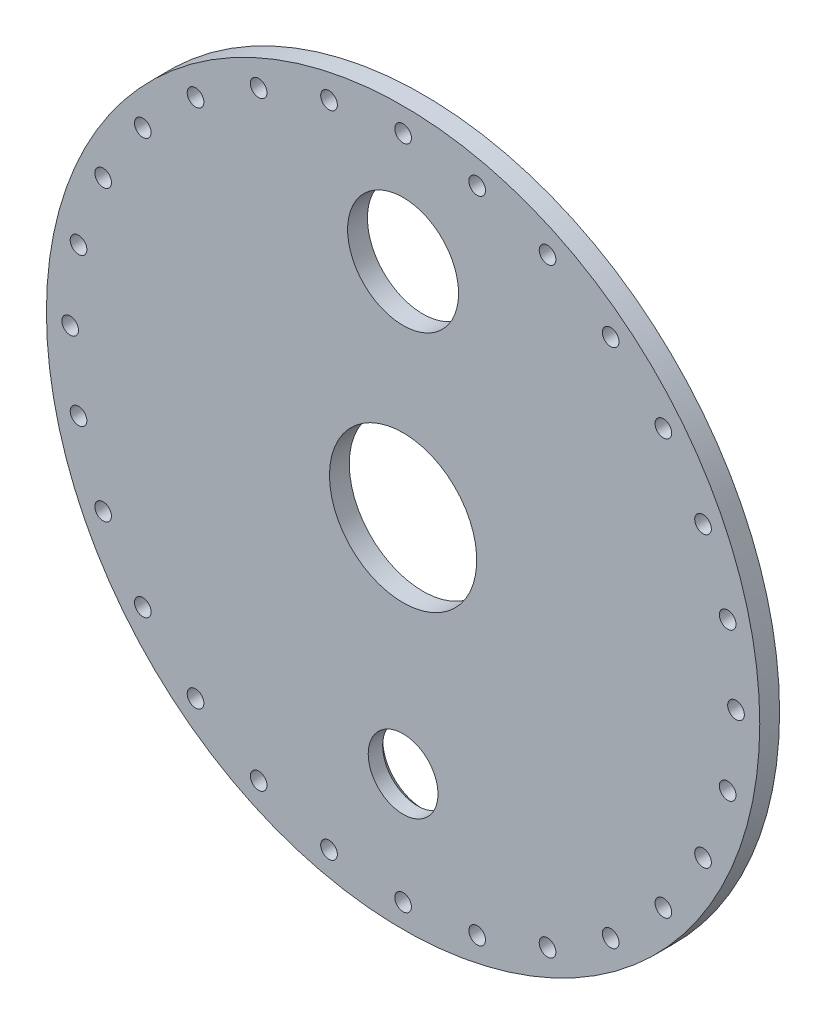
from build123d import *

# Parameters (mm, degrees)
CROQUIS1_R              = 225
SALIENTE_EXTRUIR1_DEPTH = 12.5
CROQUIS3_R              = 5.25
CORTAR_EXTRUIR4_DEPTH   = 12.5
MATRIZC1_COUNT          = 28
CROQUIS6_R              = 35
CORTAR_EXTRUIR11_DEPTH  = 12.5
CROQUIS48_R             = 46.45
CORTAR_EXTRUIR13_DEPTH  = 319.443480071


with BuildPart() as part:
    # Croquis1 → Saliente-Extruir1 (new body)
    with BuildSketch(Plane.XY):
        Circle(CROQUIS1_R)
    extrude(amount=SALIENTE_EXTRUIR1_DEPTH)

    # Croquis3 → Cortar-Extruir4 (cut)
    with BuildSketch(Plane.XY.offset(12.5)):
        with Locations((0, 210)):
            Circle(CROQUIS3_R)
    cortar_extruir4 = extrude(amount=-CORTAR_EXTRUIR4_DEPTH, mode=Mode.SUBTRACT)

    # MatrizC1: Cortar-Extruir4 ×28 about axis
    matrizc1_axis = Axis((0, 0, 0), (0, 0, 1))
    for i in range(1, MATRIZC1_COUNT):
        add(cortar_extruir4.rotate(matrizc1_axis, i * 360 / MATRIZC1_COUNT), mode=Mode.SUBTRACT)

    # Croquis6 → Cortar-Extruir11 (cut)
    with BuildSketch(Plane.XY.offset(12.5)):
        with Locations((0, 140)):
            Circle(CROQUIS6_R)
    extrude(amount=-CORTAR_EXTRUIR11_DEPTH, mode=Mode.SUBTRACT)

    # Croquis46 → Refrentado para tornillo tap_n con cabez (revolve, cut)
    with BuildSketch(Plane(origin=(0, -140, 0), x_dir=(0, 1, 0), z_dir=(1, 0, 0))):
        Polygon((0, 0), (0, 12.5), (22, 12.5), (22, 3.4), (25.4, 0), align=None)
    revolve(axis=Axis((0, -140, -6.35), (0, 0, 1)), mode=Mode.SUBTRACT)

    # Croquis48 → Cortar-Extruir13 (cut, through all)
    with BuildSketch(Plane(origin=(0, 0, 0), x_dir=(-1, 0, 0), z_dir=(0, 0, -1))):
        Circle(CROQUIS48_R)
    extrude(amount=-CORTAR_EXTRUIR13_DEPTH, mode=Mode.SUBTRACT)


solid = part.part
